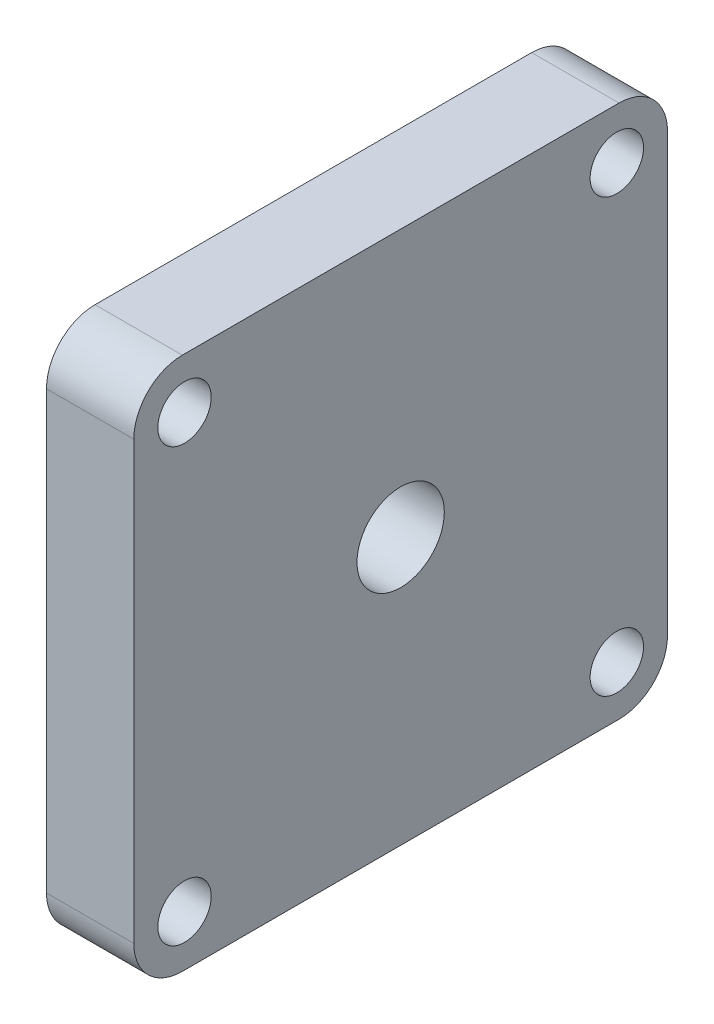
from build123d import *

# Parameters (mm, degrees)
ESQUISSE1_R             = 2.75
EXTRUSION1_DEPTH        = 9
EXTRUSION2_DEPTH        = 2
EXTRUSION2_DEPTH_BACK   = 2
ESQUISSE2_R             = 20
ESQUISSE2_R_2           = 17.5
ENL_V_MAT_EXTRU_1_REACH = 41.919
ESQUISSE3_R             = 4.5


with BuildPart() as part:
    # Esquisse1 → Extrusion1 (new body)
    with BuildSketch(Plane(origin=(0, 0, 0), x_dir=(0, 0, -1), z_dir=(1, 0, 0))):
        with BuildLine():
            Line((-22.5, -27.5), (22.5, -27.5))
            ThreePointArc((22.5, -27.5), (26.035533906, -26.035533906), (27.5, -22.5))
            Line((27.5, -22.5), (27.5, 22.5))
            ThreePointArc((27.5, 22.5), (26.035533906, 26.035533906), (22.5, 27.5))
            Line((22.5, 27.5), (-22.5, 27.5))
            ThreePointArc((-22.5, 27.5), (-26.035533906, 26.035533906), (-27.5, 22.5))
            Line((-27.5, 22.5), (-27.5, -22.5))
            ThreePointArc((-27.5, -22.5), (-26.035533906, -26.035533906), (-22.5, -27.5))
        make_face()
        with Locations((22.273863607, -22.273863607)):
            Circle(ESQUISSE1_R, mode=Mode.SUBTRACT)
        with Locations((22.273863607, 22.273863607)):
            Circle(ESQUISSE1_R, mode=Mode.SUBTRACT)
        with Locations((-22.273863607, -22.273863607)):
            Circle(ESQUISSE1_R, mode=Mode.SUBTRACT)
        with Locations((-22.273863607, 22.273863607)):
            Circle(ESQUISSE1_R, mode=Mode.SUBTRACT)
    extrude(amount=EXTRUSION1_DEPTH)

    # Esquisse2 → Extrusion2 (add, two sides: drawn at the far end of the back side and taken through both)
    with BuildSketch(Plane(origin=(0, 0, 0), x_dir=(0, 0, -1), z_dir=(1, 0, 0)).offset(-EXTRUSION2_DEPTH_BACK)):
        Circle(ESQUISSE2_R)
        Circle(ESQUISSE2_R_2, mode=Mode.SUBTRACT)
    extrude(amount=EXTRUSION2_DEPTH + EXTRUSION2_DEPTH_BACK)

    # Esquisse3 → Enl_v. mat.-Extru.1 (cut, up to next)
    with BuildSketch(Plane.ZY, mode=Mode.PRIVATE) as enl_v_mat_extru_1_sk1:
        Circle(ESQUISSE3_R)
    enl_v_mat_extru_1_tool1 = extrude(enl_v_mat_extru_1_sk1.sketch, amount=-ENL_V_MAT_EXTRU_1_REACH, mode=Mode.PRIVATE) & part.part
    add(enl_v_mat_extru_1_tool1.solids().sort_by_distance((0, 0, 0))[0], mode=Mode.SUBTRACT)


solid = part.part
